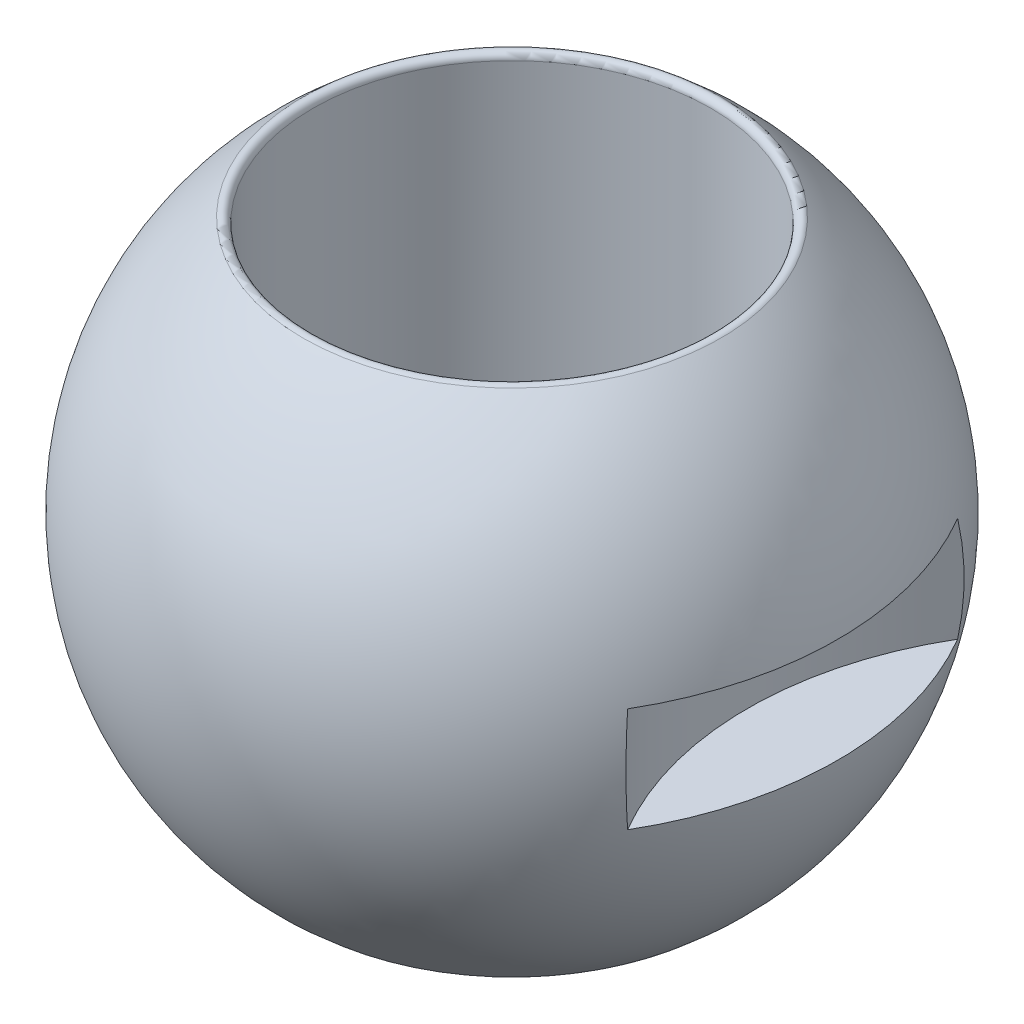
ISO-10303-21;
HEADER;
FILE_DESCRIPTION(('STEP AP214'),'2;1');
FILE_NAME('part.step','',(''),(''),'','','');
FILE_SCHEMA(('AUTOMOTIVE_DESIGN { 1 0 10303 214 1 1 1 1 }'));
ENDSEC;
DATA;
#1=APPLICATION_CONTEXT('core data for automotive mechanical design processes');
#2=APPLICATION_PROTOCOL_DEFINITION('international standard','automotive_design',2000,#1);
#3=PRODUCT_CONTEXT('',#1,'mechanical');
#4=PRODUCT('Part','Part','',(#3));
#5=PRODUCT_RELATED_PRODUCT_CATEGORY('part','',(#4));
#6=PRODUCT_DEFINITION_FORMATION('','',#4);
#7=PRODUCT_DEFINITION_CONTEXT('part definition',#1,'design');
#8=PRODUCT_DEFINITION('design','',#6,#7);
#9=PRODUCT_DEFINITION_SHAPE('','',#8);
#10=(LENGTH_UNIT() NAMED_UNIT(*) SI_UNIT(.MILLI.,.METRE.));
#11=(NAMED_UNIT(*) PLANE_ANGLE_UNIT() SI_UNIT($,.RADIAN.));
#12=(NAMED_UNIT(*) SI_UNIT($,.STERADIAN.) SOLID_ANGLE_UNIT());
#13=UNCERTAINTY_MEASURE_WITH_UNIT(LENGTH_MEASURE(1.E-05),#10,'distance_accuracy_value','');
#14=(GEOMETRIC_REPRESENTATION_CONTEXT(3) GLOBAL_UNCERTAINTY_ASSIGNED_CONTEXT((#13)) GLOBAL_UNIT_ASSIGNED_CONTEXT((#10,
#11,#12)) REPRESENTATION_CONTEXT('',''));
#15=CARTESIAN_POINT('',(0.,0.,0.));
#16=DIRECTION('',(0.,0.,1.));
#17=DIRECTION('',(1.,0.,0.));
#18=AXIS2_PLACEMENT_3D('',#15,#16,#17);
#19=CARTESIAN_POINT('',(0.,12.9866785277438,0.));
#20=DIRECTION('',(0.,1.,0.));
#21=DIRECTION('',(0.,0.,1.));
#22=AXIS2_PLACEMENT_3D('',#19,#20,#21);
#23=CYLINDRICAL_SURFACE('',#22,19.);
#24=CARTESIAN_POINT('',(0.,23.9105283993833,0.));
#25=DIRECTION('',(0.,1.,0.));
#26=DIRECTION('',(0.,0.,1.));
#27=AXIS2_PLACEMENT_3D('',#24,#25,#26);
#28=CIRCLE('',#27,19.);
#29=CARTESIAN_POINT('',(0.,23.9105283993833,19.));
#30=VERTEX_POINT('',#29);
#31=EDGE_CURVE('E70',#30,#30,#28,.T.);
#32=ORIENTED_EDGE('',*,*,#31,.T.);
#33=EDGE_LOOP('',(#32));
#34=FACE_BOUND('',#33,.T.);
#35=CARTESIAN_POINT('',(0.,-23.9105283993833,0.));
#36=DIRECTION('',(0.,1.,0.));
#37=DIRECTION('',(0.,0.,1.));
#38=AXIS2_PLACEMENT_3D('',#35,#36,#37);
#39=CIRCLE('',#38,19.);
#40=CARTESIAN_POINT('',(0.,-23.9105283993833,19.));
#41=VERTEX_POINT('',#40);
#42=EDGE_CURVE('E130',#41,#41,#39,.T.);
#43=ORIENTED_EDGE('',*,*,#42,.F.);
#44=EDGE_LOOP('',(#43));
#45=FACE_BOUND('',#44,.T.);
#46=CARTESIAN_POINT('',(18.9406969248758,3.5,1.5));
#47=CARTESIAN_POINT('',(18.940697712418,3.58411467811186,1.49999631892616));
#48=CARTESIAN_POINT('',(18.9412632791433,3.66828700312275,1.49290092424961));
#49=CARTESIAN_POINT('',(18.9434644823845,3.83430382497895,1.46469987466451));
#50=CARTESIAN_POINT('',(18.9451013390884,3.91614555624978,1.44357824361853));
#51=CARTESIAN_POINT('',(18.9492585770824,4.07507261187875,1.38793840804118));
#52=CARTESIAN_POINT('',(18.9517784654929,4.15216056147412,1.35342767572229));
#53=CARTESIAN_POINT('',(18.9574172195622,4.29943080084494,1.27200229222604));
#54=CARTESIAN_POINT('',(18.960535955,4.36961458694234,1.22509033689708));
#55=CARTESIAN_POINT('',(18.9670291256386,4.50126568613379,1.12007640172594));
#56=CARTESIAN_POINT('',(18.9704040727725,4.56271480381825,1.0619516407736));
#57=CARTESIAN_POINT('',(18.9770246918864,4.67499604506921,0.936210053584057));
#58=CARTESIAN_POINT('',(18.9802703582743,4.72582770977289,0.868592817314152));
#59=CARTESIAN_POINT('',(18.9862714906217,4.81549084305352,0.725678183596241));
#60=CARTESIAN_POINT('',(18.9890263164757,4.854306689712,0.650370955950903));
#61=CARTESIAN_POINT('',(18.9937298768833,4.91873641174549,0.494282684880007));
#62=CARTESIAN_POINT('',(18.9956786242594,4.94435049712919,0.413501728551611));
#63=CARTESIAN_POINT('',(18.9985468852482,4.98159756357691,0.248939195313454));
#64=CARTESIAN_POINT('',(18.999468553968,4.99325982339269,0.16516428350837));
#65=CARTESIAN_POINT('',(19.0001861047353,5.00236267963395,-0.00315866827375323));
#66=CARTESIAN_POINT('',(18.9999820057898,4.99980351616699,-0.0877066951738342));
#67=CARTESIAN_POINT('',(18.9984728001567,4.98056016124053,-0.254977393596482));
#68=CARTESIAN_POINT('',(18.9971701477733,4.96390745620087,-0.337703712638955));
#69=CARTESIAN_POINT('',(18.9936132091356,4.91699866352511,-0.499183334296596));
#70=CARTESIAN_POINT('',(18.9913589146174,4.88674245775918,-0.57793660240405));
#71=CARTESIAN_POINT('',(18.9861481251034,4.81345030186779,-0.729335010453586));
#72=CARTESIAN_POINT('',(18.9831908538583,4.77040021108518,-0.801973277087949));
#73=CARTESIAN_POINT('',(18.9769065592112,4.67275258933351,-0.939004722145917));
#74=CARTESIAN_POINT('',(18.9735795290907,4.61815484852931,-1.00339775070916));
#75=CARTESIAN_POINT('',(18.9669190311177,4.49878420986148,-1.12229485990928));
#76=CARTESIAN_POINT('',(18.963585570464,4.43398395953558,-1.17677148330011));
#77=CARTESIAN_POINT('',(18.9572970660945,4.29614318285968,-1.27407736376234));
#78=CARTESIAN_POINT('',(18.9543420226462,4.22310265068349,-1.31690661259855));
#79=CARTESIAN_POINT('',(18.9491443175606,4.0708358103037,-1.38970072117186));
#80=CARTESIAN_POINT('',(18.9469017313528,3.99160884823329,-1.41966421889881));
#81=CARTESIAN_POINT('',(18.9433842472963,3.82922702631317,-1.46585626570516));
#82=CARTESIAN_POINT('',(18.9421093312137,3.74607224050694,-1.48208507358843));
#83=CARTESIAN_POINT('',(18.9406744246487,3.57843531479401,-1.50031243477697));
#84=CARTESIAN_POINT('',(18.9405114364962,3.49395735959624,-1.5023492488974));
#85=CARTESIAN_POINT('',(18.9413109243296,3.32586116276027,-1.49223496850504));
#86=CARTESIAN_POINT('',(18.942273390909,3.24224291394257,-1.48008399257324));
#87=CARTESIAN_POINT('',(18.9452126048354,3.07834919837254,-1.44197092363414));
#88=CARTESIAN_POINT('',(18.947188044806,2.99806956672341,-1.41602663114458));
#89=CARTESIAN_POINT('',(18.9519295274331,2.84300302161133,-1.35108147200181));
#90=CARTESIAN_POINT('',(18.9546955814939,2.76821618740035,-1.31208041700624));
#91=CARTESIAN_POINT('',(18.9607138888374,2.62608291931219,-1.22203178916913));
#92=CARTESIAN_POINT('',(18.963967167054,2.55875270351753,-1.17095868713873));
#93=CARTESIAN_POINT('',(18.9705898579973,2.43360771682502,-1.05825267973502));
#94=CARTESIAN_POINT('',(18.9739592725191,2.3757930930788,-0.996619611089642));
#95=CARTESIAN_POINT('',(18.9804434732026,2.27119015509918,-0.864378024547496));
#96=CARTESIAN_POINT('',(18.9835576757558,2.22442667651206,-0.79374982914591));
#97=CARTESIAN_POINT('',(18.9891721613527,2.14342376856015,-0.64562111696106));
#98=CARTESIAN_POINT('',(18.9916724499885,2.10918422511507,-0.568120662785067));
#99=CARTESIAN_POINT('',(18.9957746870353,2.0542439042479,-0.408536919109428));
#100=CARTESIAN_POINT('',(18.9973776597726,2.03352768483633,-0.326458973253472));
#101=CARTESIAN_POINT('',(18.999508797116,2.00617158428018,-0.159976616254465));
#102=CARTESIAN_POINT('',(19.0000369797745,1.99953146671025,-0.0755722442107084));
#103=CARTESIAN_POINT('',(18.9999590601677,2.00051869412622,0.0929220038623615));
#104=CARTESIAN_POINT('',(18.9993560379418,2.00810729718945,0.177012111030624));
#105=CARTESIAN_POINT('',(18.9970895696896,2.03725587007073,0.342719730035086));
#106=CARTESIAN_POINT('',(18.9954261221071,2.0588158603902,0.424337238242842));
#107=CARTESIAN_POINT('',(18.9912255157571,2.11528558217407,0.582786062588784));
#108=CARTESIAN_POINT('',(18.9886883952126,2.15019472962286,0.65961758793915));
#109=CARTESIAN_POINT('',(18.9830245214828,2.23236724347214,0.806335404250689));
#110=CARTESIAN_POINT('',(18.9798977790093,2.27963038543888,0.8762218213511));
#111=CARTESIAN_POINT('',(18.9733956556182,2.3853144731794,1.00726365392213));
#112=CARTESIAN_POINT('',(18.9700196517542,2.44376399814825,1.06839598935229));
#113=CARTESIAN_POINT('',(18.963404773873,2.57011197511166,1.18000596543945));
#114=CARTESIAN_POINT('',(18.9601659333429,2.63801271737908,1.23048101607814));
#115=CARTESIAN_POINT('',(18.9541860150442,2.78145456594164,1.31940454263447));
#116=CARTESIAN_POINT('',(18.9514458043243,2.85700863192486,1.35783215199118));
#117=CARTESIAN_POINT('',(18.9467840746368,3.01346582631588,1.42140732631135));
#118=CARTESIAN_POINT('',(18.9448616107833,3.09436265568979,1.44657022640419));
#119=CARTESIAN_POINT('',(18.9425496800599,3.22978416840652,1.47646210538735));
#120=CARTESIAN_POINT('',(18.941858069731,3.28343679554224,1.48527715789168));
#121=CARTESIAN_POINT('',(18.9409314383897,3.39138493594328,1.49704728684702));
#122=CARTESIAN_POINT('',(18.940696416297,3.44568044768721,1.50000237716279));
#123=CARTESIAN_POINT('',(18.9406969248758,3.5,1.5));
#124=B_SPLINE_CURVE_WITH_KNOTS('',3,(#46,#47,#48,#49,#50,#51,#52,#53,#54,#55,#56,#57,#58,#59,
#60,#61,#62,#63,#64,#65,#66,#67,#68,#69,#70,#71,#72,#73,#74,#75,#76,#77,#78,#79,#80,#81,#82,#83,
#84,#85,#86,#87,#88,#89,#90,#91,#92,#93,#94,#95,#96,#97,#98,#99,#100,#101,#102,#103,#104,#105,
#106,#107,#108,#109,#110,#111,#112,#113,#114,#115,#116,#117,#118,#119,#120,#121,#122,#123),
.UNSPECIFIED.,.T.,.F.,(4,2,2,2,2,2,2,2,2,2,2,2,2,2,2,2,2,2,2,2,2,2,2,2,2,2,2,2,2,2,2,2,2,2,2,2,
2,2,4),(0.,0.252145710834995,0.504579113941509,0.756871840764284,1.00910976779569,
1.26186567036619,1.51463249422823,1.76772657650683,2.02081663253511,2.2733746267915,
2.52592835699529,2.77791934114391,3.02991251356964,3.28218524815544,3.53446256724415,
3.78742812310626,4.04039385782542,4.29338636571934,4.54637410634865,4.79867954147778,
5.05098286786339,5.30296137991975,5.55494352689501,5.8074633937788,6.05998716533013,
6.31307315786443,6.5661568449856,6.81895103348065,7.07174097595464,7.32384362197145,
7.57594663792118,7.82803862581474,8.08012603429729,8.33286629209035,8.58566790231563,
8.83890498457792,9.09184865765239,9.25467962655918,9.41751021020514),.UNSPECIFIED.);
#125=CARTESIAN_POINT('',(18.9406969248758,3.5,1.5));
#126=VERTEX_POINT('',#125);
#127=EDGE_CURVE('E76',#126,#126,#124,.T.);
#128=ORIENTED_EDGE('',*,*,#127,.F.);
#129=EDGE_LOOP('',(#128));
#130=FACE_BOUND('',#129,.T.);
#131=ADVANCED_FACE('F33',(#34,#45,#130),#23,.F.);
#132=CARTESIAN_POINT('',(53.5,-5.,0.));
#133=DIRECTION('',(0.,1.,0.));
#134=DIRECTION('',(0.,0.,1.));
#135=AXIS2_PLACEMENT_3D('',#132,#133,#134);
#136=CYLINDRICAL_SURFACE('',#135,31.);
#137=CARTESIAN_POINT('',(53.5,5.,0.));
#138=DIRECTION('',(0.,1.,0.));
#139=DIRECTION('',(0.,0.,1.));
#140=AXIS2_PLACEMENT_3D('',#137,#138,#139);
#141=CIRCLE('',#140,31.);
#142=CARTESIAN_POINT('',(26.8084112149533,5.,-15.7657568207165));
#143=VERTEX_POINT('',#142);
#144=CARTESIAN_POINT('',(22.5,5.,0.));
#145=VERTEX_POINT('',#144);
#146=EDGE_CURVE('E53',#143,#145,#141,.T.);
#147=ORIENTED_EDGE('',*,*,#146,.T.);
#148=CARTESIAN_POINT('',(22.5,5.,0.));
#149=CARTESIAN_POINT('',(22.5000004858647,4.99999628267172,0.084202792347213));
#150=CARTESIAN_POINT('',(22.5003467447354,4.99288607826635,0.16846538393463));
#151=CARTESIAN_POINT('',(22.5016947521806,4.96462276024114,0.334666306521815));
#152=CARTESIAN_POINT('',(22.5026972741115,4.94345307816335,0.416601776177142));
#153=CARTESIAN_POINT('',(22.5052443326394,4.8876781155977,0.575716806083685));
#154=CARTESIAN_POINT('',(22.5067885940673,4.85307965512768,0.65289875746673));
#155=CARTESIAN_POINT('',(22.510245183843,4.77143967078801,0.800338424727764));
#156=CARTESIAN_POINT('',(22.5121574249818,4.72440109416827,0.870597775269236));
#157=CARTESIAN_POINT('',(22.5161368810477,4.61916597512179,1.00228593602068));
#158=CARTESIAN_POINT('',(22.5182042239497,4.56096015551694,1.06370732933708));
#159=CARTESIAN_POINT('',(22.5222597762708,4.43506121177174,1.175912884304));
#160=CARTESIAN_POINT('',(22.5242479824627,4.36736770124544,1.22669661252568));
#161=CARTESIAN_POINT('',(22.5279219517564,4.22437657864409,1.31620530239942));
#162=CARTESIAN_POINT('',(22.5296075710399,4.14907537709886,1.35492453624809));
#163=CARTESIAN_POINT('',(22.5324847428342,3.99303167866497,1.41916837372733));
#164=CARTESIAN_POINT('',(22.5336762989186,3.91228922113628,1.44469307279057));
#165=CARTESIAN_POINT('',(22.5354298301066,3.74772264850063,1.4818038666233));
#166=CARTESIAN_POINT('',(22.5359923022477,3.66390102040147,1.49340096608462));
#167=CARTESIAN_POINT('',(22.5364257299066,3.49549901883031,1.50236131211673));
#168=CARTESIAN_POINT('',(22.5362966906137,3.410918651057,1.49972466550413));
#169=CARTESIAN_POINT('',(22.5353621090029,3.24347487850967,1.48030153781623));
#170=CARTESIAN_POINT('',(22.5345571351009,3.16061009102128,1.46352694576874));
#171=CARTESIAN_POINT('',(22.5323623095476,2.99887395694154,1.41632251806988));
#172=CARTESIAN_POINT('',(22.5309724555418,2.92000262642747,1.38589262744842));
#173=CARTESIAN_POINT('',(22.5277638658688,2.76845396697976,1.31222780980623));
#174=CARTESIAN_POINT('',(22.5259449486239,2.69577927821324,1.26898745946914));
#175=CARTESIAN_POINT('',(22.522083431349,2.55871575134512,1.17093311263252));
#176=CARTESIAN_POINT('',(22.5200408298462,2.49432696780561,1.11611903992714));
#177=CARTESIAN_POINT('',(22.515959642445,2.37559381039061,0.996406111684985));
#178=CARTESIAN_POINT('',(22.5139210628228,2.32125981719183,0.931496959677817));
#179=CARTESIAN_POINT('',(22.5100797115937,2.22425856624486,0.793472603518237));
#180=CARTESIAN_POINT('',(22.5082769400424,2.18159131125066,0.720357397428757));
#181=CARTESIAN_POINT('',(22.505110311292,2.10913571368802,0.567990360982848));
#182=CARTESIAN_POINT('',(22.5037464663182,2.07934772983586,0.48873835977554));
#183=CARTESIAN_POINT('',(22.5016115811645,2.03350301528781,0.326350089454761));
#184=CARTESIAN_POINT('',(22.5008405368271,2.01744618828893,0.243213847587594));
#185=CARTESIAN_POINT('',(22.4999786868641,1.99953236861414,0.0755071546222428));
#186=CARTESIAN_POINT('',(22.4998871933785,1.99766101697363,-0.00906175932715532));
#187=CARTESIAN_POINT('',(22.5003929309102,2.00813380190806,-0.177312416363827));
#188=CARTESIAN_POINT('',(22.5009901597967,2.02047789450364,-0.260994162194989));
#189=CARTESIAN_POINT('',(22.5028056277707,2.05901928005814,-0.425054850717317));
#190=CARTESIAN_POINT('',(22.504023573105,2.08521002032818,-0.505435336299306));
#191=CARTESIAN_POINT('',(22.5069433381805,2.15069459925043,-0.660659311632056));
#192=CARTESIAN_POINT('',(22.5086451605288,2.18998850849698,-0.735502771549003));
#193=CARTESIAN_POINT('',(22.5123429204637,2.28060080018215,-0.877594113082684));
#194=CARTESIAN_POINT('',(22.5143390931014,2.3319288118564,-0.944835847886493));
#195=CARTESIAN_POINT('',(22.518399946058,2.44513821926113,-1.069753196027));
#196=CARTESIAN_POINT('',(22.5204646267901,2.50701967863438,-1.12742875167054));
#197=CARTESIAN_POINT('',(22.5244317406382,2.63964114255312,-1.23162484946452));
#198=CARTESIAN_POINT('',(22.5263340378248,2.71038844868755,-1.27813610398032));
#199=CARTESIAN_POINT('',(22.5297597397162,2.85869642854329,-1.35861984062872));
#200=CARTESIAN_POINT('',(22.5312831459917,2.93625707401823,-1.39259237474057));
#201=CARTESIAN_POINT('',(22.5337783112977,3.09595560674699,-1.44701811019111));
#202=CARTESIAN_POINT('',(22.5347503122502,3.17809146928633,-1.4674772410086));
#203=CARTESIAN_POINT('',(22.5360337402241,3.34463726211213,-1.49431480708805));
#204=CARTESIAN_POINT('',(22.5363451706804,3.42904718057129,-1.50069331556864));
#205=CARTESIAN_POINT('',(22.5362722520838,3.59765252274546,-1.49918787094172));
#206=CARTESIAN_POINT('',(22.535888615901,3.68184807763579,-1.49131853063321));
#207=CARTESIAN_POINT('',(22.534470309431,3.84772120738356,-1.46157096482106));
#208=CARTESIAN_POINT('',(22.5334356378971,3.92939877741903,-1.43969271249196));
#209=CARTESIAN_POINT('',(22.5308320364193,4.08792060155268,-1.38255130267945));
#210=CARTESIAN_POINT('',(22.5292631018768,4.16476481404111,-1.34728802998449));
#211=CARTESIAN_POINT('',(22.5257678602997,4.31144285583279,-1.26438019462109));
#212=CARTESIAN_POINT('',(22.5238415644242,4.38127690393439,-1.21673601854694));
#213=CARTESIAN_POINT('',(22.5198464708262,4.51202505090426,-1.11036684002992));
#214=CARTESIAN_POINT('',(22.5177775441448,4.57293091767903,-1.05163172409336));
#215=CARTESIAN_POINT('',(22.5137312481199,4.68403664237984,-0.924753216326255));
#216=CARTESIAN_POINT('',(22.5117539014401,4.73423386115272,-0.856607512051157));
#217=CARTESIAN_POINT('',(22.5081122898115,4.8225193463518,-0.712791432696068));
#218=CARTESIAN_POINT('',(22.5064483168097,4.86059634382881,-0.637114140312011));
#219=CARTESIAN_POINT('',(22.5036253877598,4.92345862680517,-0.480489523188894));
#220=CARTESIAN_POINT('',(22.5024658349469,4.94825962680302,-0.399548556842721));
#221=CARTESIAN_POINT('',(22.5010894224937,4.97735387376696,-0.265086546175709));
#222=CARTESIAN_POINT('',(22.5006826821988,4.98583534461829,-0.212436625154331));
#223=CARTESIAN_POINT('',(22.5001378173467,4.99715958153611,-0.106532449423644));
#224=CARTESIAN_POINT('',(22.4999996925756,5.00000235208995,-0.0532781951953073));
#225=CARTESIAN_POINT('',(22.5,5.,0.));
#226=B_SPLINE_CURVE_WITH_KNOTS('',3,(#148,#149,#150,#151,#152,#153,#154,#155,#156,#157,#158,
#159,#160,#161,#162,#163,#164,#165,#166,#167,#168,#169,#170,#171,#172,#173,#174,#175,#176,#177,
#178,#179,#180,#181,#182,#183,#184,#185,#186,#187,#188,#189,#190,#191,#192,#193,#194,#195,#196,
#197,#198,#199,#200,#201,#202,#203,#204,#205,#206,#207,#208,#209,#210,#211,#212,#213,#214,#215,
#216,#217,#218,#219,#220,#221,#222,#223,#224,#225),.UNSPECIFIED.,.T.,.F.,(4,2,2,2,2,2,2,2,2,2,2,
2,2,2,2,2,2,2,2,2,2,2,2,2,2,2,2,2,2,2,2,2,2,2,2,2,2,2,4),(0.,0.252413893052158,
0.505125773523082,0.757709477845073,1.01023339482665,1.26296801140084,1.51571292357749,
1.76857764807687,2.02144054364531,2.27410351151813,2.52676458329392,2.7792133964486,
3.03166322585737,3.28422008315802,3.53677860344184,3.78959643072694,4.04241431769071,
4.29523924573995,4.54806240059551,4.80062960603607,5.053196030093,5.30564303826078,
5.55809140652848,5.8107424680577,6.06339505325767,6.31625709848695,6.56911809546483,
6.82186806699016,7.0746167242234,7.32710630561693,7.57959637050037,7.83208860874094,
8.08457296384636,8.33728867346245,8.59006659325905,8.84307885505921,9.09579096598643,
9.25550262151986,9.41521414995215),.UNSPECIFIED.);
#227=EDGE_CURVE('E46',#145,#145,#226,.T.);
#228=ORIENTED_EDGE('',*,*,#227,.F.);
#229=CARTESIAN_POINT('',(26.8084112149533,5.,15.7657568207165));
#230=VERTEX_POINT('',#229);
#231=EDGE_CURVE('E66',#145,#230,#141,.T.);
#232=ORIENTED_EDGE('',*,*,#231,.T.);
#233=CARTESIAN_POINT('',(26.8083925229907,-5.0002,15.7657251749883));
#234=CARTESIAN_POINT('',(26.8470787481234,-4.58643258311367,15.8311836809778));
#235=CARTESIAN_POINT('',(26.8810995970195,-4.17091278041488,15.8882679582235));
#236=CARTESIAN_POINT('',(26.9395875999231,-3.33727874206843,15.9858703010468));
#237=CARTESIAN_POINT('',(26.9640551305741,-2.91916460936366,16.0263890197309));
#238=CARTESIAN_POINT('',(27.0030576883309,-2.08462060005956,16.0907851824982));
#239=CARTESIAN_POINT('',(27.017671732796,-1.66820460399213,16.1147950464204));
#240=CARTESIAN_POINT('',(27.0371709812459,-0.834525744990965,16.1467969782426));
#241=CARTESIAN_POINT('',(27.0420560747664,-0.417262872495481,16.1547888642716));
#242=CARTESIAN_POINT('',(27.0420560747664,0.417262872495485,16.1547888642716));
#243=CARTESIAN_POINT('',(27.0371709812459,0.834525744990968,16.1467969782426));
#244=CARTESIAN_POINT('',(27.017671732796,1.66820460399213,16.1147950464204));
#245=CARTESIAN_POINT('',(27.0030576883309,2.08462060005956,16.0907851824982));
#246=CARTESIAN_POINT('',(26.9640551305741,2.91916460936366,16.0263890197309));
#247=CARTESIAN_POINT('',(26.9395875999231,3.33727874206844,15.9858703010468));
#248=CARTESIAN_POINT('',(26.8810995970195,4.17091278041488,15.8882679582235));
#249=CARTESIAN_POINT('',(26.8470787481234,4.58643258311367,15.8311836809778));
#250=CARTESIAN_POINT('',(26.8083925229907,5.0002,15.7657251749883));
#251=B_SPLINE_CURVE_WITH_KNOTS('',3,(#233,#234,#235,#236,#237,#238,#239,#240,#241,#242,#243,
#244,#245,#246,#247,#248,#249,#250),.UNSPECIFIED.,.F.,.F.,(4,2,2,2,2,2,2,2,4),(0.,
1.26196254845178,2.52387533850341,3.77554421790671,5.02722730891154,6.27891039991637,
7.53057927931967,8.7924920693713,10.0544546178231),.UNSPECIFIED.);
#252=CARTESIAN_POINT('',(26.8084112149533,-5.,15.7657568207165));
#253=VERTEX_POINT('',#252);
#254=EDGE_CURVE('E69',#253,#230,#251,.T.);
#255=ORIENTED_EDGE('',*,*,#254,.F.);
#256=CARTESIAN_POINT('',(53.5,-5.,0.));
#257=DIRECTION('',(0.,1.,0.));
#258=DIRECTION('',(0.,0.,1.));
#259=AXIS2_PLACEMENT_3D('',#256,#257,#258);
#260=CIRCLE('',#259,31.);
#261=CARTESIAN_POINT('',(26.8084112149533,-5.,-15.7657568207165));
#262=VERTEX_POINT('',#261);
#263=EDGE_CURVE('E142',#262,#253,#260,.T.);
#264=ORIENTED_EDGE('',*,*,#263,.F.);
#265=CARTESIAN_POINT('',(26.8083925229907,5.0002,-15.7657251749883));
#266=CARTESIAN_POINT('',(26.8470787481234,4.58643258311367,-15.8311836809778));
#267=CARTESIAN_POINT('',(26.8810995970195,4.17091278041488,-15.8882679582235));
#268=CARTESIAN_POINT('',(26.9395875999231,3.33727874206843,-15.9858703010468));
#269=CARTESIAN_POINT('',(26.9640551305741,2.91916460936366,-16.0263890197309));
#270=CARTESIAN_POINT('',(27.0030576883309,2.08462060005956,-16.0907851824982));
#271=CARTESIAN_POINT('',(27.017671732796,1.66820460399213,-16.1147950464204));
#272=CARTESIAN_POINT('',(27.0371709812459,0.834525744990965,-16.1467969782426));
#273=CARTESIAN_POINT('',(27.0420560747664,0.417262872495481,-16.1547888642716));
#274=CARTESIAN_POINT('',(27.0420560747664,-0.417262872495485,-16.1547888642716));
#275=CARTESIAN_POINT('',(27.0371709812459,-0.834525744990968,-16.1467969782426));
#276=CARTESIAN_POINT('',(27.017671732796,-1.66820460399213,-16.1147950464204));
#277=CARTESIAN_POINT('',(27.0030576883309,-2.08462060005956,-16.0907851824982));
#278=CARTESIAN_POINT('',(26.9640551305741,-2.91916460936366,-16.0263890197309));
#279=CARTESIAN_POINT('',(26.9395875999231,-3.33727874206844,-15.9858703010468));
#280=CARTESIAN_POINT('',(26.8810995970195,-4.17091278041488,-15.8882679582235));
#281=CARTESIAN_POINT('',(26.8470787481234,-4.58643258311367,-15.8311836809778));
#282=CARTESIAN_POINT('',(26.8083925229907,-5.0002,-15.7657251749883));
#283=B_SPLINE_CURVE_WITH_KNOTS('',3,(#265,#266,#267,#268,#269,#270,#271,#272,#273,#274,#275,
#276,#277,#278,#279,#280,#281,#282),.UNSPECIFIED.,.F.,.F.,(4,2,2,2,2,2,2,2,4),(0.,
1.26196254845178,2.52387533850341,3.77554421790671,5.02722730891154,6.27891039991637,
7.53057927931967,8.7924920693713,10.0544546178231),.UNSPECIFIED.);
#284=EDGE_CURVE('E41',#143,#262,#283,.T.);
#285=ORIENTED_EDGE('',*,*,#284,.F.);
#286=EDGE_LOOP('',(#147,#228,#232,#255,#264,#285));
#287=FACE_BOUND('',#286,.T.);
#288=ADVANCED_FACE('F73',(#287),#136,.F.);
#289=CARTESIAN_POINT('',(0.,0.,0.));
#290=DIRECTION('',(0.,1.,0.));
#291=DIRECTION('',(1.,0.,0.));
#292=AXIS2_PLACEMENT_3D('',#289,#290,#291);
#293=SPHERICAL_SURFACE('',#292,31.5);
#294=CARTESIAN_POINT('',(0.,-24.3665082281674,0.));
#295=DIRECTION('',(0.,1.,0.));
#296=DIRECTION('',(0.,0.,1.));
#297=AXIS2_PLACEMENT_3D('',#294,#295,#296);
#298=CIRCLE('',#297,19.9630477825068);
#299=CARTESIAN_POINT('',(0.,-24.3665082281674,19.9630477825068));
#300=VERTEX_POINT('',#299);
#301=EDGE_CURVE('E135',#300,#300,#298,.T.);
#302=ORIENTED_EDGE('',*,*,#301,.T.);
#303=EDGE_LOOP('',(#302));
#304=FACE_BOUND('',#303,.T.);
#305=CARTESIAN_POINT('',(0.,24.3665082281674,0.));
#306=DIRECTION('',(0.,1.,0.));
#307=DIRECTION('',(0.,0.,1.));
#308=AXIS2_PLACEMENT_3D('',#305,#306,#307);
#309=CIRCLE('',#308,19.9630477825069);
#310=CARTESIAN_POINT('',(0.,24.3665082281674,19.9630477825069));
#311=VERTEX_POINT('',#310);
#312=EDGE_CURVE('E138',#311,#311,#309,.T.);
#313=ORIENTED_EDGE('',*,*,#312,.F.);
#314=EDGE_LOOP('',(#313));
#315=FACE_BOUND('',#314,.T.);
#316=ORIENTED_EDGE('',*,*,#284,.T.);
#317=CARTESIAN_POINT('',(0.,-5.,0.));
#318=DIRECTION('',(0.,-1.,0.));
#319=DIRECTION('',(0.,0.,-1.));
#320=AXIS2_PLACEMENT_3D('',#317,#318,#319);
#321=CIRCLE('',#320,31.100643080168);
#322=EDGE_CURVE('E11',#262,#253,#321,.T.);
#323=ORIENTED_EDGE('',*,*,#322,.T.);
#324=ORIENTED_EDGE('',*,*,#254,.T.);
#325=CARTESIAN_POINT('',(0.,5.,0.));
#326=DIRECTION('',(0.,-1.,0.));
#327=DIRECTION('',(0.,0.,-1.));
#328=AXIS2_PLACEMENT_3D('',#325,#326,#327);
#329=CIRCLE('',#328,31.100643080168);
#330=EDGE_CURVE('E63',#143,#230,#329,.T.);
#331=ORIENTED_EDGE('',*,*,#330,.F.);
#332=EDGE_LOOP('',(#316,#323,#324,#331));
#333=FACE_BOUND('',#332,.T.);
#334=ADVANCED_FACE('F78',(#304,#315,#333),#293,.T.);
#335=CARTESIAN_POINT('',(0.,23.9105283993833,0.));
#336=DIRECTION('',(0.,1.,0.));
#337=DIRECTION('',(0.,0.,1.));
#338=AXIS2_PLACEMENT_3D('',#335,#336,#337);
#339=TOROIDAL_SURFACE('',#338,19.5894716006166,0.589471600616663);
#340=ORIENTED_EDGE('',*,*,#31,.F.);
#341=EDGE_LOOP('',(#340));
#342=FACE_BOUND('',#341,.T.);
#343=ORIENTED_EDGE('',*,*,#312,.T.);
#344=EDGE_LOOP('',(#343));
#345=FACE_BOUND('',#344,.T.);
#346=ADVANCED_FACE('F35',(#342,#345),#339,.T.);
#347=CARTESIAN_POINT('',(0.,-23.9105283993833,0.));
#348=DIRECTION('',(0.,1.,0.));
#349=DIRECTION('',(0.,0.,1.));
#350=AXIS2_PLACEMENT_3D('',#347,#348,#349);
#351=TOROIDAL_SURFACE('',#350,19.5894716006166,0.589471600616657);
#352=ORIENTED_EDGE('',*,*,#301,.F.);
#353=EDGE_LOOP('',(#352));
#354=FACE_BOUND('',#353,.T.);
#355=ORIENTED_EDGE('',*,*,#42,.T.);
#356=EDGE_LOOP('',(#355));
#357=FACE_BOUND('',#356,.T.);
#358=ADVANCED_FACE('F112',(#354,#357),#351,.T.);
#359=CARTESIAN_POINT('',(26.75,-5.,0.));
#360=DIRECTION('',(0.,-1.,0.));
#361=DIRECTION('',(0.,0.,-1.));
#362=AXIS2_PLACEMENT_3D('',#359,#360,#361);
#363=PLANE('',#362);
#364=ORIENTED_EDGE('',*,*,#263,.T.);
#365=ORIENTED_EDGE('',*,*,#322,.F.);
#366=EDGE_LOOP('',(#364,#365));
#367=FACE_BOUND('',#366,.T.);
#368=ADVANCED_FACE('F109',(#367),#363,.F.);
#369=CARTESIAN_POINT('',(26.75,5.,0.));
#370=DIRECTION('',(0.,-1.,0.));
#371=DIRECTION('',(0.,0.,-1.));
#372=AXIS2_PLACEMENT_3D('',#369,#370,#371);
#373=PLANE('',#372);
#374=ORIENTED_EDGE('',*,*,#330,.T.);
#375=ORIENTED_EDGE('',*,*,#231,.F.);
#376=ORIENTED_EDGE('',*,*,#146,.F.);
#377=EDGE_LOOP('',(#374,#375,#376));
#378=FACE_BOUND('',#377,.T.);
#379=ADVANCED_FACE('F65',(#378),#373,.T.);
#380=CARTESIAN_POINT('',(31.100643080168,3.5,0.));
#381=DIRECTION('',(-1.,0.,0.));
#382=DIRECTION('',(0.,0.,1.));
#383=AXIS2_PLACEMENT_3D('',#380,#381,#382);
#384=CYLINDRICAL_SURFACE('',#383,1.5);
#385=ORIENTED_EDGE('',*,*,#227,.T.);
#386=EDGE_LOOP('',(#385));
#387=FACE_BOUND('',#386,.T.);
#388=ORIENTED_EDGE('',*,*,#127,.T.);
#389=EDGE_LOOP('',(#388));
#390=FACE_BOUND('',#389,.T.);
#391=ADVANCED_FACE('F106',(#387,#390),#384,.F.);
#392=CLOSED_SHELL('',(#131,#288,#334,#346,#358,#368,#379,#391));
#393=MANIFOLD_SOLID_BREP('B2',#392);
#394=ADVANCED_BREP_SHAPE_REPRESENTATION('',(#18,#393),#14);
#395=SHAPE_DEFINITION_REPRESENTATION(#9,#394);
ENDSEC;
END-ISO-10303-21;
